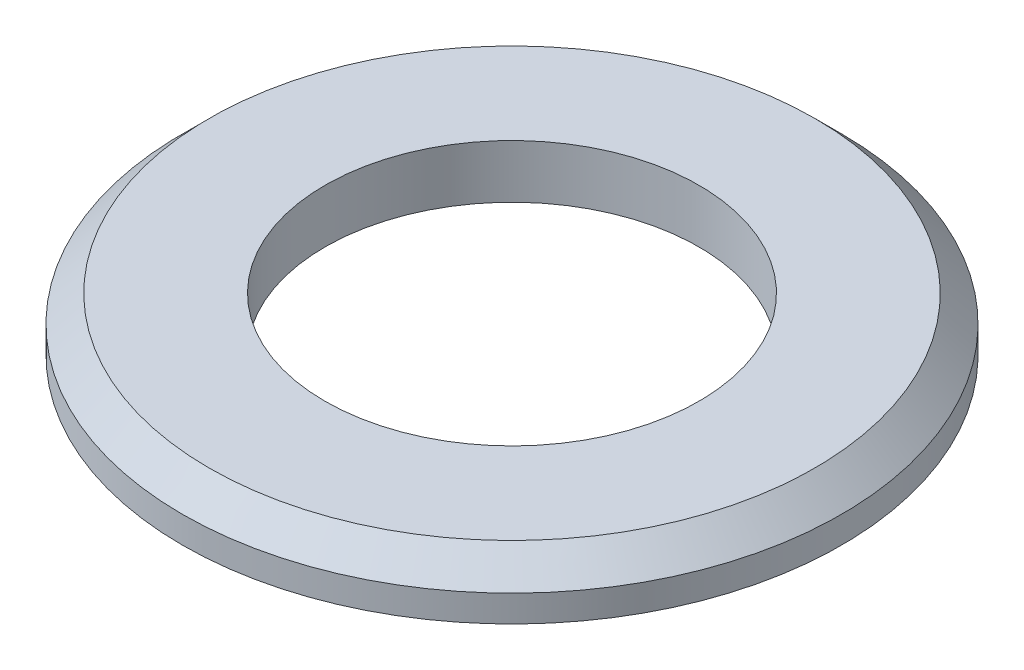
from build123d import *

# Parameters (mm, degrees)
SKETCH1_R      = 18.5
SKETCH1_R_2    = 10.5
EXTRUDE1_DEPTH = 3
CHAMFER1_SIZE  = 1.5


with BuildPart() as part:
    # Sketch1 → Extrude1 (new body)
    with BuildSketch(Plane(origin=(0, 0, 0), x_dir=(1, 0, 0), z_dir=(0, 1, 0))):
        with Locations(Location((0, 0, 0), (0, 0, 270))):
            Circle(SKETCH1_R)
        with Locations(Location((0, 0, 0), (0, 0, 270))):
            Circle(SKETCH1_R_2, mode=Mode.SUBTRACT)
    extrude(amount=EXTRUDE1_DEPTH)

    # Chamfer1
    chamfer1_edges = [part.edges().sort_by_distance(p)[0] for p in [
        (0, 3, -18.5),
    ]]
    chamfer(chamfer1_edges, length=CHAMFER1_SIZE)


solid = part.part
